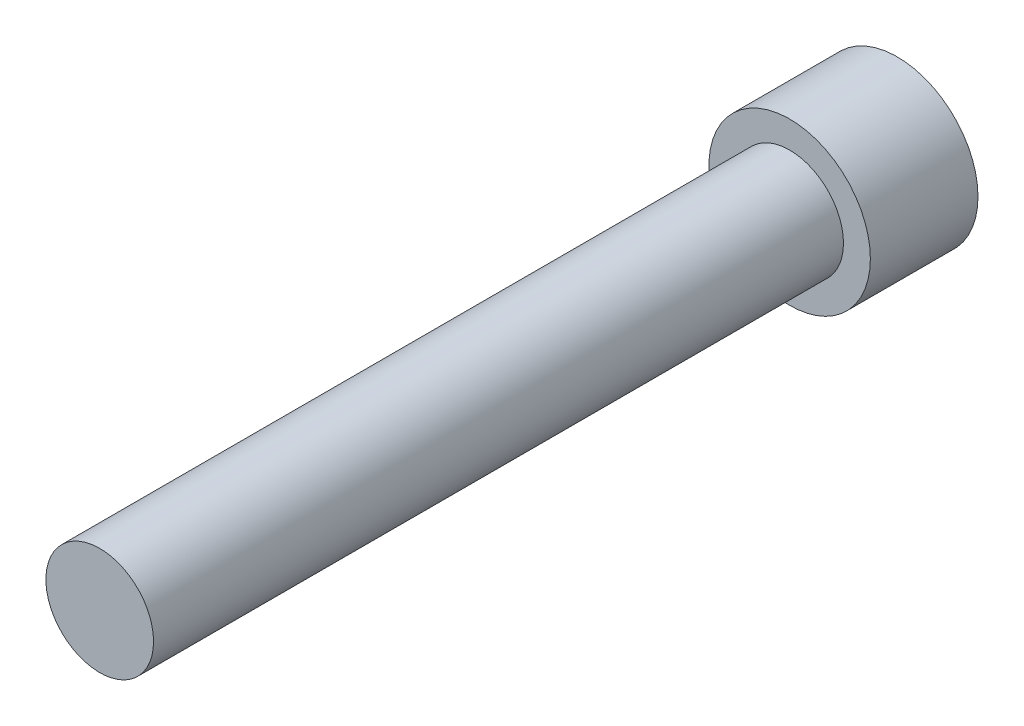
ISO-10303-21;
HEADER;
FILE_DESCRIPTION(('STEP AP214'),'2;1');
FILE_NAME('part.step','',(''),(''),'','','');
FILE_SCHEMA(('AUTOMOTIVE_DESIGN { 1 0 10303 214 1 1 1 1 }'));
ENDSEC;
DATA;
#1=APPLICATION_CONTEXT('core data for automotive mechanical design processes');
#2=APPLICATION_PROTOCOL_DEFINITION('international standard','automotive_design',2000,#1);
#3=PRODUCT_CONTEXT('',#1,'mechanical');
#4=PRODUCT('Part','Part','',(#3));
#5=PRODUCT_RELATED_PRODUCT_CATEGORY('part','',(#4));
#6=PRODUCT_DEFINITION_FORMATION('','',#4);
#7=PRODUCT_DEFINITION_CONTEXT('part definition',#1,'design');
#8=PRODUCT_DEFINITION('design','',#6,#7);
#9=PRODUCT_DEFINITION_SHAPE('','',#8);
#10=(LENGTH_UNIT() NAMED_UNIT(*) SI_UNIT(.MILLI.,.METRE.));
#11=(NAMED_UNIT(*) PLANE_ANGLE_UNIT() SI_UNIT($,.RADIAN.));
#12=(NAMED_UNIT(*) SI_UNIT($,.STERADIAN.) SOLID_ANGLE_UNIT());
#13=UNCERTAINTY_MEASURE_WITH_UNIT(LENGTH_MEASURE(1.E-05),#10,'distance_accuracy_value','');
#14=(GEOMETRIC_REPRESENTATION_CONTEXT(3) GLOBAL_UNCERTAINTY_ASSIGNED_CONTEXT((#13)) GLOBAL_UNIT_ASSIGNED_CONTEXT((#10,
#11,#12)) REPRESENTATION_CONTEXT('',''));
#15=CARTESIAN_POINT('',(0.,0.,0.));
#16=DIRECTION('',(0.,0.,1.));
#17=DIRECTION('',(1.,0.,0.));
#18=AXIS2_PLACEMENT_3D('',#15,#16,#17);
#19=CARTESIAN_POINT('',(0.,0.,50.8));
#20=DIRECTION('',(0.,0.,1.));
#21=DIRECTION('',(1.,0.,0.));
#22=AXIS2_PLACEMENT_3D('',#19,#20,#21);
#23=PLANE('',#22);
#24=CARTESIAN_POINT('',(0.,0.,50.8));
#25=DIRECTION('',(0.,0.,1.));
#26=DIRECTION('',(1.,0.,0.));
#27=AXIS2_PLACEMENT_3D('',#24,#25,#26);
#28=CIRCLE('',#27,3.9624);
#29=CARTESIAN_POINT('',(3.9624,0.,50.8));
#30=VERTEX_POINT('',#29);
#31=EDGE_CURVE('E11',#30,#30,#28,.T.);
#32=ORIENTED_EDGE('',*,*,#31,.T.);
#33=EDGE_LOOP('',(#32));
#34=FACE_BOUND('',#33,.T.);
#35=ADVANCED_FACE('F32',(#34),#23,.T.);
#36=CARTESIAN_POINT('',(0.,0.,50.8));
#37=DIRECTION('',(0.,0.,1.));
#38=DIRECTION('',(1.,0.,0.));
#39=AXIS2_PLACEMENT_3D('',#36,#37,#38);
#40=CYLINDRICAL_SURFACE('',#39,3.9624);
#41=CARTESIAN_POINT('',(0.,0.,0.));
#42=DIRECTION('',(0.,0.,1.));
#43=DIRECTION('',(1.,0.,0.));
#44=AXIS2_PLACEMENT_3D('',#41,#42,#43);
#45=CIRCLE('',#44,3.9624);
#46=CARTESIAN_POINT('',(3.9624,0.,0.));
#47=VERTEX_POINT('',#46);
#48=EDGE_CURVE('E39',#47,#47,#45,.T.);
#49=ORIENTED_EDGE('',*,*,#48,.T.);
#50=EDGE_LOOP('',(#49));
#51=FACE_BOUND('',#50,.T.);
#52=ORIENTED_EDGE('',*,*,#31,.F.);
#53=EDGE_LOOP('',(#52));
#54=FACE_BOUND('',#53,.T.);
#55=ADVANCED_FACE('F146',(#51,#54),#40,.T.);
#56=CARTESIAN_POINT('',(0.,-3.9624,0.));
#57=DIRECTION('',(0.,0.,1.));
#58=DIRECTION('',(1.,0.,0.));
#59=AXIS2_PLACEMENT_3D('',#56,#57,#58);
#60=PLANE('',#59);
#61=CARTESIAN_POINT('',(0.,0.,0.));
#62=DIRECTION('',(0.,0.,1.));
#63=DIRECTION('',(1.,0.,0.));
#64=AXIS2_PLACEMENT_3D('',#61,#62,#63);
#65=CIRCLE('',#64,5.9436);
#66=CARTESIAN_POINT('',(5.9436,0.,0.));
#67=VERTEX_POINT('',#66);
#68=EDGE_CURVE('E141',#67,#67,#65,.T.);
#69=ORIENTED_EDGE('',*,*,#68,.T.);
#70=EDGE_LOOP('',(#69));
#71=FACE_BOUND('',#70,.T.);
#72=ORIENTED_EDGE('',*,*,#48,.F.);
#73=EDGE_LOOP('',(#72));
#74=FACE_BOUND('',#73,.T.);
#75=ADVANCED_FACE('F149',(#71,#74),#60,.T.);
#76=CARTESIAN_POINT('',(0.,0.,50.8));
#77=DIRECTION('',(0.,0.,1.));
#78=DIRECTION('',(1.,0.,0.));
#79=AXIS2_PLACEMENT_3D('',#76,#77,#78);
#80=CYLINDRICAL_SURFACE('',#79,5.9436);
#81=CARTESIAN_POINT('',(0.,0.,-7.9248));
#82=DIRECTION('',(0.,0.,1.));
#83=DIRECTION('',(1.,0.,0.));
#84=AXIS2_PLACEMENT_3D('',#81,#82,#83);
#85=CIRCLE('',#84,5.9436);
#86=CARTESIAN_POINT('',(5.9436,0.,-7.9248));
#87=VERTEX_POINT('',#86);
#88=EDGE_CURVE('E133',#87,#87,#85,.T.);
#89=ORIENTED_EDGE('',*,*,#88,.T.);
#90=EDGE_LOOP('',(#89));
#91=FACE_BOUND('',#90,.T.);
#92=ORIENTED_EDGE('',*,*,#68,.F.);
#93=EDGE_LOOP('',(#92));
#94=FACE_BOUND('',#93,.T.);
#95=ADVANCED_FACE('F151',(#91,#94),#80,.T.);
#96=CARTESIAN_POINT('',(0.,-5.9436,-7.9248));
#97=DIRECTION('',(0.,0.,-1.));
#98=DIRECTION('',(-1.,0.,0.));
#99=AXIS2_PLACEMENT_3D('',#96,#97,#98);
#100=PLANE('',#99);
#101=DIRECTION('',(0.866025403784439,-0.5,0.));
#102=VECTOR('',#101,1.);
#103=CARTESIAN_POINT('',(0.,3.66617420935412,-7.9248));
#104=LINE('',#103,#102);
#105=CARTESIAN_POINT('',(0.,3.66617420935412,-7.9248));
#106=VERTEX_POINT('',#105);
#107=CARTESIAN_POINT('',(3.175,1.83308710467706,-7.9248));
#108=VERTEX_POINT('',#107);
#109=EDGE_CURVE('E46',#106,#108,#104,.T.);
#110=ORIENTED_EDGE('',*,*,#109,.F.);
#111=DIRECTION('',(0.866025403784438,0.5,0.));
#112=VECTOR('',#111,1.);
#113=CARTESIAN_POINT('',(-3.175,1.83308710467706,-7.9248));
#114=LINE('',#113,#112);
#115=CARTESIAN_POINT('',(-3.175,1.83308710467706,-7.9248));
#116=VERTEX_POINT('',#115);
#117=EDGE_CURVE('E129',#116,#106,#114,.T.);
#118=ORIENTED_EDGE('',*,*,#117,.F.);
#119=DIRECTION('',(0.,1.,0.));
#120=VECTOR('',#119,1.);
#121=CARTESIAN_POINT('',(-3.175,-1.83308710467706,-7.9248));
#122=LINE('',#121,#120);
#123=CARTESIAN_POINT('',(-3.175,-1.83308710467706,-7.9248));
#124=VERTEX_POINT('',#123);
#125=EDGE_CURVE('E127',#124,#116,#122,.T.);
#126=ORIENTED_EDGE('',*,*,#125,.F.);
#127=DIRECTION('',(-0.866025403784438,0.5,0.));
#128=VECTOR('',#127,1.);
#129=CARTESIAN_POINT('',(0.,-3.66617420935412,-7.9248));
#130=LINE('',#129,#128);
#131=CARTESIAN_POINT('',(0.,-3.66617420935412,-7.9248));
#132=VERTEX_POINT('',#131);
#133=EDGE_CURVE('E94',#132,#124,#130,.T.);
#134=ORIENTED_EDGE('',*,*,#133,.F.);
#135=DIRECTION('',(-0.866025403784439,-0.5,0.));
#136=VECTOR('',#135,1.);
#137=CARTESIAN_POINT('',(3.175,-1.83308710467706,-7.9248));
#138=LINE('',#137,#136);
#139=CARTESIAN_POINT('',(3.175,-1.83308710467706,-7.9248));
#140=VERTEX_POINT('',#139);
#141=EDGE_CURVE('E123',#140,#132,#138,.T.);
#142=ORIENTED_EDGE('',*,*,#141,.F.);
#143=DIRECTION('',(0.,-1.,0.));
#144=VECTOR('',#143,1.);
#145=CARTESIAN_POINT('',(3.175,1.83308710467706,-7.9248));
#146=LINE('',#145,#144);
#147=EDGE_CURVE('E120',#108,#140,#146,.T.);
#148=ORIENTED_EDGE('',*,*,#147,.F.);
#149=EDGE_LOOP('',(#110,#118,#126,#134,#142,#148));
#150=FACE_BOUND('',#149,.T.);
#151=ORIENTED_EDGE('',*,*,#88,.F.);
#152=EDGE_LOOP('',(#151));
#153=FACE_BOUND('',#152,.T.);
#154=ADVANCED_FACE('F158',(#150,#153),#100,.T.);
#155=CARTESIAN_POINT('',(0.,3.66617420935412,-3.0988));
#156=DIRECTION('',(0.5,0.866025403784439,0.));
#157=DIRECTION('',(-0.866025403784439,0.5,0.));
#158=AXIS2_PLACEMENT_3D('',#155,#156,#157);
#159=PLANE('',#158);
#160=ORIENTED_EDGE('',*,*,#109,.T.);
#161=DIRECTION('',(0.,0.,-1.));
#162=VECTOR('',#161,1.);
#163=CARTESIAN_POINT('',(3.175,1.83308710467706,-3.0988));
#164=LINE('',#163,#162);
#165=CARTESIAN_POINT('',(3.175,1.83308710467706,-3.0988));
#166=VERTEX_POINT('',#165);
#167=EDGE_CURVE('E76',#166,#108,#164,.T.);
#168=ORIENTED_EDGE('',*,*,#167,.F.);
#169=DIRECTION('',(0.866025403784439,-0.5,0.));
#170=VECTOR('',#169,1.);
#171=CARTESIAN_POINT('',(0.,3.66617420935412,-3.0988));
#172=LINE('',#171,#170);
#173=CARTESIAN_POINT('',(0.,3.66617420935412,-3.0988));
#174=VERTEX_POINT('',#173);
#175=EDGE_CURVE('E131',#174,#166,#172,.T.);
#176=ORIENTED_EDGE('',*,*,#175,.F.);
#177=DIRECTION('',(0.,0.,-1.));
#178=VECTOR('',#177,1.);
#179=CARTESIAN_POINT('',(0.,3.66617420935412,-3.0988));
#180=LINE('',#179,#178);
#181=EDGE_CURVE('E54',#174,#106,#180,.T.);
#182=ORIENTED_EDGE('',*,*,#181,.T.);
#183=EDGE_LOOP('',(#160,#168,#176,#182));
#184=FACE_BOUND('',#183,.T.);
#185=ADVANCED_FACE('F189',(#184),#159,.F.);
#186=CARTESIAN_POINT('',(-3.175,1.83308710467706,-3.0988));
#187=DIRECTION('',(-0.5,0.866025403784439,0.));
#188=DIRECTION('',(-0.866025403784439,-0.5,0.));
#189=AXIS2_PLACEMENT_3D('',#186,#187,#188);
#190=PLANE('',#189);
#191=ORIENTED_EDGE('',*,*,#117,.T.);
#192=ORIENTED_EDGE('',*,*,#181,.F.);
#193=DIRECTION('',(0.866025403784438,0.5,0.));
#194=VECTOR('',#193,1.);
#195=CARTESIAN_POINT('',(-3.175,1.83308710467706,-3.0988));
#196=LINE('',#195,#194);
#197=CARTESIAN_POINT('',(-3.175,1.83308710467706,-3.0988));
#198=VERTEX_POINT('',#197);
#199=EDGE_CURVE('E106',#198,#174,#196,.T.);
#200=ORIENTED_EDGE('',*,*,#199,.F.);
#201=DIRECTION('',(0.,0.,-1.));
#202=VECTOR('',#201,1.);
#203=CARTESIAN_POINT('',(-3.175,1.83308710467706,-3.0988));
#204=LINE('',#203,#202);
#205=EDGE_CURVE('E98',#198,#116,#204,.T.);
#206=ORIENTED_EDGE('',*,*,#205,.T.);
#207=EDGE_LOOP('',(#191,#192,#200,#206));
#208=FACE_BOUND('',#207,.T.);
#209=ADVANCED_FACE('F199',(#208),#190,.F.);
#210=CARTESIAN_POINT('',(-3.175,-1.83308710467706,-3.0988));
#211=DIRECTION('',(-1.,0.,0.));
#212=DIRECTION('',(0.,-1.,0.));
#213=AXIS2_PLACEMENT_3D('',#210,#211,#212);
#214=PLANE('',#213);
#215=ORIENTED_EDGE('',*,*,#125,.T.);
#216=ORIENTED_EDGE('',*,*,#205,.F.);
#217=DIRECTION('',(0.,1.,0.));
#218=VECTOR('',#217,1.);
#219=CARTESIAN_POINT('',(-3.175,-1.83308710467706,-3.0988));
#220=LINE('',#219,#218);
#221=CARTESIAN_POINT('',(-3.175,-1.83308710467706,-3.0988));
#222=VERTEX_POINT('',#221);
#223=EDGE_CURVE('E102',#222,#198,#220,.T.);
#224=ORIENTED_EDGE('',*,*,#223,.F.);
#225=DIRECTION('',(0.,0.,-1.));
#226=VECTOR('',#225,1.);
#227=CARTESIAN_POINT('',(-3.175,-1.83308710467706,-3.0988));
#228=LINE('',#227,#226);
#229=EDGE_CURVE('E87',#222,#124,#228,.T.);
#230=ORIENTED_EDGE('',*,*,#229,.T.);
#231=EDGE_LOOP('',(#215,#216,#224,#230));
#232=FACE_BOUND('',#231,.T.);
#233=ADVANCED_FACE('F103',(#232),#214,.F.);
#234=CARTESIAN_POINT('',(0.,-3.66617420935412,-3.0988));
#235=DIRECTION('',(-0.5,-0.866025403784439,0.));
#236=DIRECTION('',(0.866025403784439,-0.5,0.));
#237=AXIS2_PLACEMENT_3D('',#234,#235,#236);
#238=PLANE('',#237);
#239=ORIENTED_EDGE('',*,*,#133,.T.);
#240=ORIENTED_EDGE('',*,*,#229,.F.);
#241=DIRECTION('',(-0.866025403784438,0.5,0.));
#242=VECTOR('',#241,1.);
#243=CARTESIAN_POINT('',(0.,-3.66617420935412,-3.0988));
#244=LINE('',#243,#242);
#245=CARTESIAN_POINT('',(0.,-3.66617420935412,-3.0988));
#246=VERTEX_POINT('',#245);
#247=EDGE_CURVE('E91',#246,#222,#244,.T.);
#248=ORIENTED_EDGE('',*,*,#247,.F.);
#249=DIRECTION('',(0.,0.,-1.));
#250=VECTOR('',#249,1.);
#251=CARTESIAN_POINT('',(0.,-3.66617420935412,-3.0988));
#252=LINE('',#251,#250);
#253=EDGE_CURVE('E99',#246,#132,#252,.T.);
#254=ORIENTED_EDGE('',*,*,#253,.T.);
#255=EDGE_LOOP('',(#239,#240,#248,#254));
#256=FACE_BOUND('',#255,.T.);
#257=ADVANCED_FACE('F89',(#256),#238,.F.);
#258=CARTESIAN_POINT('',(3.175,-1.83308710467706,-3.0988));
#259=DIRECTION('',(0.5,-0.866025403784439,0.));
#260=DIRECTION('',(0.866025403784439,0.5,0.));
#261=AXIS2_PLACEMENT_3D('',#258,#259,#260);
#262=PLANE('',#261);
#263=ORIENTED_EDGE('',*,*,#141,.T.);
#264=ORIENTED_EDGE('',*,*,#253,.F.);
#265=DIRECTION('',(-0.866025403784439,-0.5,0.));
#266=VECTOR('',#265,1.);
#267=CARTESIAN_POINT('',(3.175,-1.83308710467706,-3.0988));
#268=LINE('',#267,#266);
#269=CARTESIAN_POINT('',(3.175,-1.83308710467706,-3.0988));
#270=VERTEX_POINT('',#269);
#271=EDGE_CURVE('E112',#270,#246,#268,.T.);
#272=ORIENTED_EDGE('',*,*,#271,.F.);
#273=DIRECTION('',(0.,0.,-1.));
#274=VECTOR('',#273,1.);
#275=CARTESIAN_POINT('',(3.175,-1.83308710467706,-3.0988));
#276=LINE('',#275,#274);
#277=EDGE_CURVE('E136',#270,#140,#276,.T.);
#278=ORIENTED_EDGE('',*,*,#277,.T.);
#279=EDGE_LOOP('',(#263,#264,#272,#278));
#280=FACE_BOUND('',#279,.T.);
#281=ADVANCED_FACE('F224',(#280),#262,.F.);
#282=CARTESIAN_POINT('',(3.175,1.83308710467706,-3.0988));
#283=DIRECTION('',(1.,0.,0.));
#284=DIRECTION('',(0.,0.,-1.));
#285=AXIS2_PLACEMENT_3D('',#282,#283,#284);
#286=PLANE('',#285);
#287=ORIENTED_EDGE('',*,*,#147,.T.);
#288=ORIENTED_EDGE('',*,*,#277,.F.);
#289=DIRECTION('',(0.,-1.,0.));
#290=VECTOR('',#289,1.);
#291=CARTESIAN_POINT('',(3.175,1.83308710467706,-3.0988));
#292=LINE('',#291,#290);
#293=EDGE_CURVE('E114',#166,#270,#292,.T.);
#294=ORIENTED_EDGE('',*,*,#293,.F.);
#295=ORIENTED_EDGE('',*,*,#167,.T.);
#296=EDGE_LOOP('',(#287,#288,#294,#295));
#297=FACE_BOUND('',#296,.T.);
#298=ADVANCED_FACE('F233',(#297),#286,.F.);
#299=CARTESIAN_POINT('',(0.,3.66617420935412,-3.0988));
#300=DIRECTION('',(0.,0.,1.));
#301=DIRECTION('',(1.,0.,0.));
#302=AXIS2_PLACEMENT_3D('',#299,#300,#301);
#303=PLANE('',#302);
#304=ORIENTED_EDGE('',*,*,#175,.T.);
#305=ORIENTED_EDGE('',*,*,#293,.T.);
#306=ORIENTED_EDGE('',*,*,#271,.T.);
#307=ORIENTED_EDGE('',*,*,#247,.T.);
#308=ORIENTED_EDGE('',*,*,#223,.T.);
#309=ORIENTED_EDGE('',*,*,#199,.T.);
#310=EDGE_LOOP('',(#304,#305,#306,#307,#308,#309));
#311=FACE_BOUND('',#310,.T.);
#312=ADVANCED_FACE('F109',(#311),#303,.F.);
#313=CLOSED_SHELL('',(#35,#55,#75,#95,#154,#185,#209,#233,#257,#281,#298,#312));
#314=MANIFOLD_SOLID_BREP('B2',#313);
#315=ADVANCED_BREP_SHAPE_REPRESENTATION('',(#18,#314),#14);
#316=SHAPE_DEFINITION_REPRESENTATION(#9,#315);
ENDSEC;
END-ISO-10303-21;
